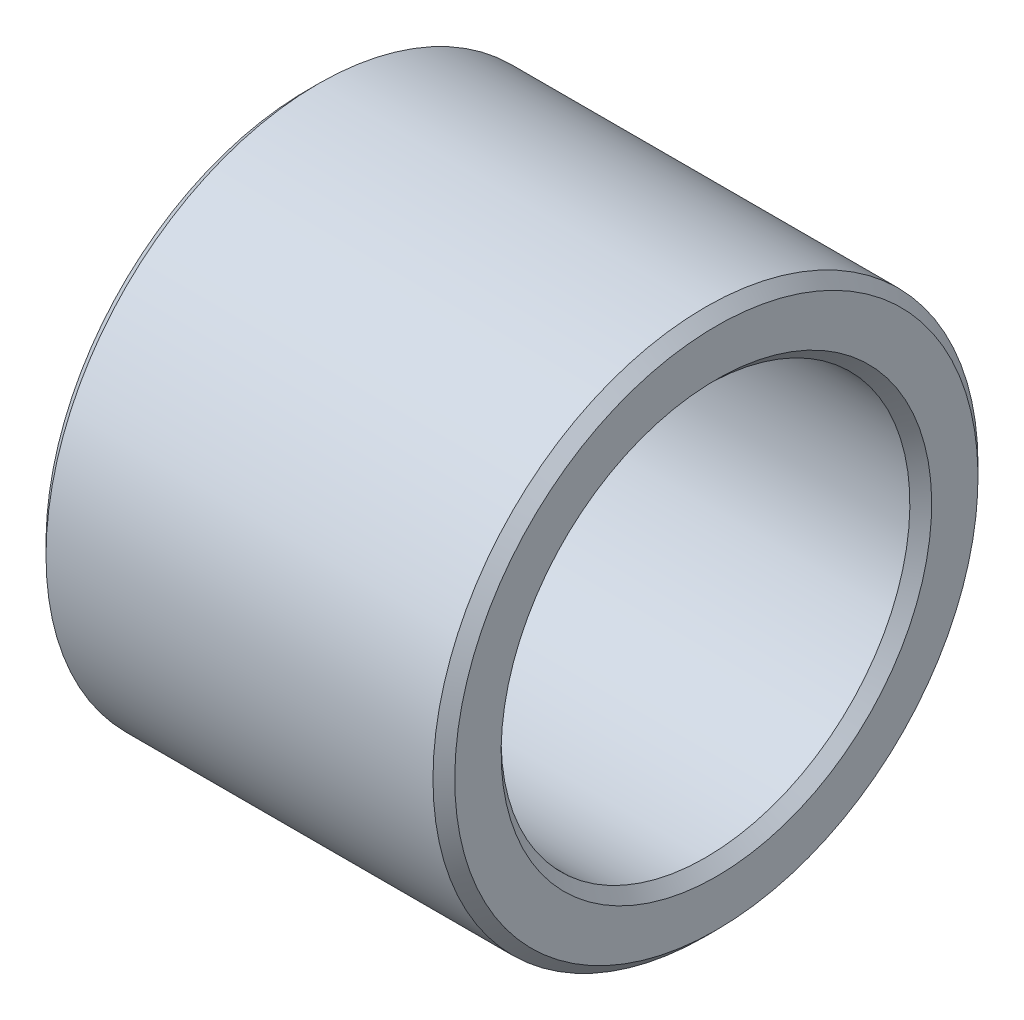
ISO-10303-21;
HEADER;
FILE_DESCRIPTION(('STEP AP214'),'2;1');
FILE_NAME('part.step','',(''),(''),'','','');
FILE_SCHEMA(('AUTOMOTIVE_DESIGN { 1 0 10303 214 1 1 1 1 }'));
ENDSEC;
DATA;
#1=APPLICATION_CONTEXT('core data for automotive mechanical design processes');
#2=APPLICATION_PROTOCOL_DEFINITION('international standard','automotive_design',2000,#1);
#3=PRODUCT_CONTEXT('',#1,'mechanical');
#4=PRODUCT('Part','Part','',(#3));
#5=PRODUCT_RELATED_PRODUCT_CATEGORY('part','',(#4));
#6=PRODUCT_DEFINITION_FORMATION('','',#4);
#7=PRODUCT_DEFINITION_CONTEXT('part definition',#1,'design');
#8=PRODUCT_DEFINITION('design','',#6,#7);
#9=PRODUCT_DEFINITION_SHAPE('','',#8);
#10=(LENGTH_UNIT() NAMED_UNIT(*) SI_UNIT(.MILLI.,.METRE.));
#11=(NAMED_UNIT(*) PLANE_ANGLE_UNIT() SI_UNIT($,.RADIAN.));
#12=(NAMED_UNIT(*) SI_UNIT($,.STERADIAN.) SOLID_ANGLE_UNIT());
#13=UNCERTAINTY_MEASURE_WITH_UNIT(LENGTH_MEASURE(1.E-05),#10,'distance_accuracy_value','');
#14=(GEOMETRIC_REPRESENTATION_CONTEXT(3) GLOBAL_UNCERTAINTY_ASSIGNED_CONTEXT((#13)) GLOBAL_UNIT_ASSIGNED_CONTEXT((#10,
#11,#12)) REPRESENTATION_CONTEXT('',''));
#15=CARTESIAN_POINT('',(0.,0.,0.));
#16=DIRECTION('',(0.,0.,1.));
#17=DIRECTION('',(1.,0.,0.));
#18=AXIS2_PLACEMENT_3D('',#15,#16,#17);
#19=CARTESIAN_POINT('',(0.,-8.75,0.));
#20=DIRECTION('',(-1.,0.,0.));
#21=DIRECTION('',(0.,1.,0.));
#22=AXIS2_PLACEMENT_3D('',#19,#20,#21);
#23=PLANE('',#22);
#24=CARTESIAN_POINT('',(0.,0.,0.));
#25=DIRECTION('',(1.,0.,0.));
#26=DIRECTION('',(0.,-1.,0.));
#27=AXIS2_PLACEMENT_3D('',#24,#25,#26);
#28=CIRCLE('',#27,7.9);
#29=CARTESIAN_POINT('',(0.,-7.9,0.));
#30=VERTEX_POINT('',#29);
#31=EDGE_CURVE('E9',#30,#30,#28,.T.);
#32=ORIENTED_EDGE('',*,*,#31,.T.);
#33=EDGE_LOOP('',(#32));
#34=FACE_BOUND('',#33,.T.);
#35=CARTESIAN_POINT('',(0.,0.,0.));
#36=DIRECTION('',(1.,0.,0.));
#37=DIRECTION('',(0.,-1.,0.));
#38=AXIS2_PLACEMENT_3D('',#35,#36,#37);
#39=CIRCLE('',#38,9.6);
#40=CARTESIAN_POINT('',(0.,-9.6,0.));
#41=VERTEX_POINT('',#40);
#42=EDGE_CURVE('E53',#41,#41,#39,.T.);
#43=ORIENTED_EDGE('',*,*,#42,.F.);
#44=EDGE_LOOP('',(#43));
#45=FACE_BOUND('',#44,.T.);
#46=ADVANCED_FACE('F15',(#34,#45),#23,.T.);
#47=CARTESIAN_POINT('',(0.2,0.,0.));
#48=DIRECTION('',(-1.,0.,0.));
#49=DIRECTION('',(0.,-1.,0.));
#50=AXIS2_PLACEMENT_3D('',#47,#48,#49);
#51=CONICAL_SURFACE('',#50,7.7,0.785398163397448);
#52=CARTESIAN_POINT('',(0.4,0.,0.));
#53=DIRECTION('',(1.,0.,0.));
#54=DIRECTION('',(0.,-1.,0.));
#55=AXIS2_PLACEMENT_3D('',#52,#53,#54);
#56=CIRCLE('',#55,7.5);
#57=CARTESIAN_POINT('',(0.4,-7.5,0.));
#58=VERTEX_POINT('',#57);
#59=EDGE_CURVE('E22',#58,#58,#56,.T.);
#60=ORIENTED_EDGE('',*,*,#59,.T.);
#61=EDGE_LOOP('',(#60));
#62=FACE_BOUND('',#61,.T.);
#63=ORIENTED_EDGE('',*,*,#31,.F.);
#64=EDGE_LOOP('',(#63));
#65=FACE_BOUND('',#64,.T.);
#66=ADVANCED_FACE('F82',(#62,#65),#51,.F.);
#67=CARTESIAN_POINT('',(7.5,0.,0.));
#68=DIRECTION('',(-1.,0.,0.));
#69=DIRECTION('',(0.,-1.,0.));
#70=AXIS2_PLACEMENT_3D('',#67,#68,#69);
#71=CYLINDRICAL_SURFACE('',#70,7.5);
#72=CARTESIAN_POINT('',(14.6,0.,0.));
#73=DIRECTION('',(1.,0.,0.));
#74=DIRECTION('',(0.,-1.,0.));
#75=AXIS2_PLACEMENT_3D('',#72,#73,#74);
#76=CIRCLE('',#75,7.5);
#77=CARTESIAN_POINT('',(14.6,-7.5,0.));
#78=VERTEX_POINT('',#77);
#79=EDGE_CURVE('E58',#78,#78,#76,.T.);
#80=ORIENTED_EDGE('',*,*,#79,.T.);
#81=EDGE_LOOP('',(#80));
#82=FACE_BOUND('',#81,.T.);
#83=ORIENTED_EDGE('',*,*,#59,.F.);
#84=EDGE_LOOP('',(#83));
#85=FACE_BOUND('',#84,.T.);
#86=ADVANCED_FACE('F66',(#82,#85),#71,.F.);
#87=CARTESIAN_POINT('',(14.8,0.,0.));
#88=DIRECTION('',(1.,0.,0.));
#89=DIRECTION('',(0.,-1.,0.));
#90=AXIS2_PLACEMENT_3D('',#87,#88,#89);
#91=CONICAL_SURFACE('',#90,7.7,0.785398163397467);
#92=CARTESIAN_POINT('',(15.,0.,0.));
#93=DIRECTION('',(1.,0.,0.));
#94=DIRECTION('',(0.,-1.,0.));
#95=AXIS2_PLACEMENT_3D('',#92,#93,#94);
#96=CIRCLE('',#95,7.9);
#97=CARTESIAN_POINT('',(15.,-7.9,0.));
#98=VERTEX_POINT('',#97);
#99=EDGE_CURVE('E63',#98,#98,#96,.T.);
#100=ORIENTED_EDGE('',*,*,#99,.T.);
#101=EDGE_LOOP('',(#100));
#102=FACE_BOUND('',#101,.T.);
#103=ORIENTED_EDGE('',*,*,#79,.F.);
#104=EDGE_LOOP('',(#103));
#105=FACE_BOUND('',#104,.T.);
#106=ADVANCED_FACE('F69',(#102,#105),#91,.F.);
#107=CARTESIAN_POINT('',(15.,-8.75,0.));
#108=DIRECTION('',(1.,0.,0.));
#109=DIRECTION('',(0.,-1.,0.));
#110=AXIS2_PLACEMENT_3D('',#107,#108,#109);
#111=PLANE('',#110);
#112=CARTESIAN_POINT('',(15.,0.,0.));
#113=DIRECTION('',(1.,0.,0.));
#114=DIRECTION('',(0.,-1.,0.));
#115=AXIS2_PLACEMENT_3D('',#112,#113,#114);
#116=CIRCLE('',#115,9.6);
#117=CARTESIAN_POINT('',(15.,-9.6,0.));
#118=VERTEX_POINT('',#117);
#119=EDGE_CURVE('E61',#118,#118,#116,.T.);
#120=ORIENTED_EDGE('',*,*,#119,.T.);
#121=EDGE_LOOP('',(#120));
#122=FACE_BOUND('',#121,.T.);
#123=ORIENTED_EDGE('',*,*,#99,.F.);
#124=EDGE_LOOP('',(#123));
#125=FACE_BOUND('',#124,.T.);
#126=ADVANCED_FACE('F71',(#122,#125),#111,.T.);
#127=CARTESIAN_POINT('',(14.8,0.,0.));
#128=DIRECTION('',(-1.,0.,0.));
#129=DIRECTION('',(0.,-1.,0.));
#130=AXIS2_PLACEMENT_3D('',#127,#128,#129);
#131=CONICAL_SURFACE('',#130,9.8,0.785398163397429);
#132=CARTESIAN_POINT('',(14.6,0.,0.));
#133=DIRECTION('',(1.,0.,0.));
#134=DIRECTION('',(0.,-1.,0.));
#135=AXIS2_PLACEMENT_3D('',#132,#133,#134);
#136=CIRCLE('',#135,10.);
#137=CARTESIAN_POINT('',(14.6,-10.,0.));
#138=VERTEX_POINT('',#137);
#139=EDGE_CURVE('E55',#138,#138,#136,.T.);
#140=ORIENTED_EDGE('',*,*,#139,.T.);
#141=EDGE_LOOP('',(#140));
#142=FACE_BOUND('',#141,.T.);
#143=ORIENTED_EDGE('',*,*,#119,.F.);
#144=EDGE_LOOP('',(#143));
#145=FACE_BOUND('',#144,.T.);
#146=ADVANCED_FACE('F79',(#142,#145),#131,.T.);
#147=CARTESIAN_POINT('',(7.5,0.,0.));
#148=DIRECTION('',(-1.,0.,0.));
#149=DIRECTION('',(0.,-1.,0.));
#150=AXIS2_PLACEMENT_3D('',#147,#148,#149);
#151=CYLINDRICAL_SURFACE('',#150,10.);
#152=CARTESIAN_POINT('',(0.4,0.,0.));
#153=DIRECTION('',(1.,0.,0.));
#154=DIRECTION('',(0.,-1.,0.));
#155=AXIS2_PLACEMENT_3D('',#152,#153,#154);
#156=CIRCLE('',#155,10.);
#157=CARTESIAN_POINT('',(0.4,-10.,0.));
#158=VERTEX_POINT('',#157);
#159=EDGE_CURVE('E49',#158,#158,#156,.T.);
#160=ORIENTED_EDGE('',*,*,#159,.T.);
#161=EDGE_LOOP('',(#160));
#162=FACE_BOUND('',#161,.T.);
#163=ORIENTED_EDGE('',*,*,#139,.F.);
#164=EDGE_LOOP('',(#163));
#165=FACE_BOUND('',#164,.T.);
#166=ADVANCED_FACE('F50',(#162,#165),#151,.T.);
#167=CARTESIAN_POINT('',(0.2,0.,0.));
#168=DIRECTION('',(1.,0.,0.));
#169=DIRECTION('',(0.,-1.,0.));
#170=AXIS2_PLACEMENT_3D('',#167,#168,#169);
#171=CONICAL_SURFACE('',#170,9.8,0.785398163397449);
#172=ORIENTED_EDGE('',*,*,#42,.T.);
#173=EDGE_LOOP('',(#172));
#174=FACE_BOUND('',#173,.T.);
#175=ORIENTED_EDGE('',*,*,#159,.F.);
#176=EDGE_LOOP('',(#175));
#177=FACE_BOUND('',#176,.T.);
#178=ADVANCED_FACE('F92',(#174,#177),#171,.T.);
#179=CLOSED_SHELL('',(#46,#66,#86,#106,#126,#146,#166,#178));
#180=MANIFOLD_SOLID_BREP('B1',#179);
#181=ADVANCED_BREP_SHAPE_REPRESENTATION('',(#18,#180),#14);
#182=SHAPE_DEFINITION_REPRESENTATION(#9,#181);
ENDSEC;
END-ISO-10303-21;
